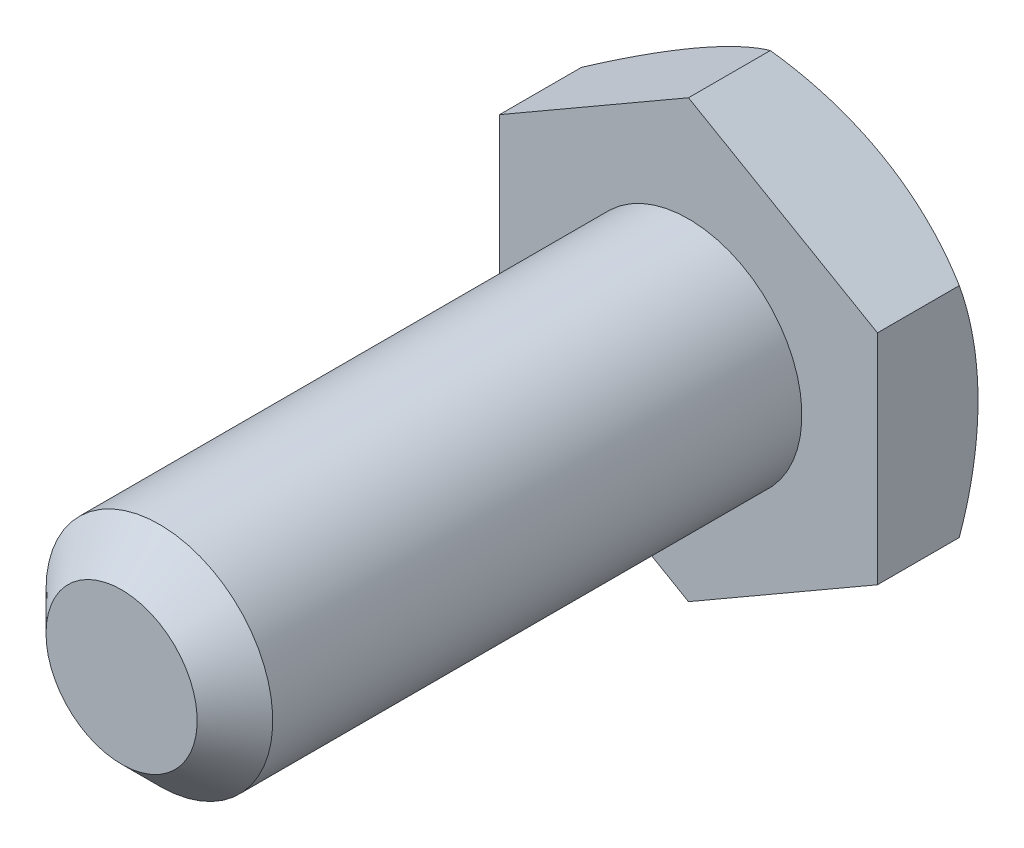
ISO-10303-21;
HEADER;
FILE_DESCRIPTION(('STEP AP214'),'2;1');
FILE_NAME('part.step','',(''),(''),'','','');
FILE_SCHEMA(('AUTOMOTIVE_DESIGN { 1 0 10303 214 1 1 1 1 }'));
ENDSEC;
DATA;
#1=APPLICATION_CONTEXT('core data for automotive mechanical design processes');
#2=APPLICATION_PROTOCOL_DEFINITION('international standard','automotive_design',2000,#1);
#3=PRODUCT_CONTEXT('',#1,'mechanical');
#4=PRODUCT('Part','Part','',(#3));
#5=PRODUCT_RELATED_PRODUCT_CATEGORY('part','',(#4));
#6=PRODUCT_DEFINITION_FORMATION('','',#4);
#7=PRODUCT_DEFINITION_CONTEXT('part definition',#1,'design');
#8=PRODUCT_DEFINITION('design','',#6,#7);
#9=PRODUCT_DEFINITION_SHAPE('','',#8);
#10=(LENGTH_UNIT() NAMED_UNIT(*) SI_UNIT(.MILLI.,.METRE.));
#11=(NAMED_UNIT(*) PLANE_ANGLE_UNIT() SI_UNIT($,.RADIAN.));
#12=(NAMED_UNIT(*) SI_UNIT($,.STERADIAN.) SOLID_ANGLE_UNIT());
#13=UNCERTAINTY_MEASURE_WITH_UNIT(LENGTH_MEASURE(1.E-05),#10,'distance_accuracy_value','');
#14=(GEOMETRIC_REPRESENTATION_CONTEXT(3) GLOBAL_UNCERTAINTY_ASSIGNED_CONTEXT((#13)) GLOBAL_UNIT_ASSIGNED_CONTEXT((#10,
#11,#12)) REPRESENTATION_CONTEXT('',''));
#15=CARTESIAN_POINT('',(0.,0.,0.));
#16=DIRECTION('',(0.,0.,1.));
#17=DIRECTION('',(1.,0.,0.));
#18=AXIS2_PLACEMENT_3D('',#15,#16,#17);
#19=CARTESIAN_POINT('',(0.,2.,19.));
#20=DIRECTION('',(0.,0.,-1.));
#21=DIRECTION('',(-1.,0.,0.));
#22=AXIS2_PLACEMENT_3D('',#19,#20,#21);
#23=PLANE('',#22);
#24=CARTESIAN_POINT('',(0.,0.,19.));
#25=DIRECTION('',(0.,0.,-1.));
#26=DIRECTION('',(-1.,0.,0.));
#27=AXIS2_PLACEMENT_3D('',#24,#25,#26);
#28=CIRCLE('',#27,2.);
#29=CARTESIAN_POINT('',(-2.,0.,19.));
#30=VERTEX_POINT('',#29);
#31=EDGE_CURVE('E9',#30,#30,#28,.T.);
#32=ORIENTED_EDGE('',*,*,#31,.F.);
#33=EDGE_LOOP('',(#32));
#34=FACE_BOUND('',#33,.T.);
#35=ADVANCED_FACE('F14',(#34),#23,.F.);
#36=CARTESIAN_POINT('',(0.,0.,19.));
#37=DIRECTION('',(0.,0.,-1.));
#38=DIRECTION('',(-1.,0.,0.));
#39=AXIS2_PLACEMENT_3D('',#36,#37,#38);
#40=CONICAL_SURFACE('',#39,2.,0.785398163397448);
#41=CARTESIAN_POINT('',(0.,0.,18.));
#42=DIRECTION('',(0.,0.,-1.));
#43=DIRECTION('',(-1.,0.,0.));
#44=AXIS2_PLACEMENT_3D('',#41,#42,#43);
#45=CIRCLE('',#44,3.);
#46=CARTESIAN_POINT('',(-3.,0.,18.));
#47=VERTEX_POINT('',#46);
#48=EDGE_CURVE('E22',#47,#47,#45,.T.);
#49=ORIENTED_EDGE('',*,*,#48,.F.);
#50=EDGE_LOOP('',(#49));
#51=FACE_BOUND('',#50,.T.);
#52=ORIENTED_EDGE('',*,*,#31,.T.);
#53=EDGE_LOOP('',(#52));
#54=FACE_BOUND('',#53,.T.);
#55=ADVANCED_FACE('F118',(#51,#54),#40,.T.);
#56=CARTESIAN_POINT('',(0.,0.,-22.7262674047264));
#57=DIRECTION('',(0.,0.,-1.));
#58=DIRECTION('',(-1.,0.,0.));
#59=AXIS2_PLACEMENT_3D('',#56,#57,#58);
#60=CYLINDRICAL_SURFACE('',#59,3.);
#61=CARTESIAN_POINT('',(0.,0.,4.));
#62=DIRECTION('',(0.,0.,-1.));
#63=DIRECTION('',(-1.,0.,0.));
#64=AXIS2_PLACEMENT_3D('',#61,#62,#63);
#65=CIRCLE('',#64,3.);
#66=CARTESIAN_POINT('',(-3.,0.,4.));
#67=VERTEX_POINT('',#66);
#68=EDGE_CURVE('E111',#67,#67,#65,.T.);
#69=ORIENTED_EDGE('',*,*,#68,.F.);
#70=EDGE_LOOP('',(#69));
#71=FACE_BOUND('',#70,.T.);
#72=ORIENTED_EDGE('',*,*,#48,.T.);
#73=EDGE_LOOP('',(#72));
#74=FACE_BOUND('',#73,.T.);
#75=ADVANCED_FACE('F116',(#71,#74),#60,.T.);
#76=CARTESIAN_POINT('',(0.,5.77350269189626,4.));
#77=DIRECTION('',(0.,0.,-1.));
#78=DIRECTION('',(-1.,0.,0.));
#79=AXIS2_PLACEMENT_3D('',#76,#77,#78);
#80=PLANE('',#79);
#81=DIRECTION('',(0.,1.,0.));
#82=VECTOR('',#81,1.);
#83=CARTESIAN_POINT('',(5.,5.77350269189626,4.));
#84=LINE('',#83,#82);
#85=CARTESIAN_POINT('',(5.,-2.88675134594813,4.));
#86=VERTEX_POINT('',#85);
#87=CARTESIAN_POINT('',(5.,2.88675134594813,4.));
#88=VERTEX_POINT('',#87);
#89=EDGE_CURVE('E64',#86,#88,#84,.T.);
#90=ORIENTED_EDGE('',*,*,#89,.T.);
#91=DIRECTION('',(-0.866025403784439,0.5,0.));
#92=VECTOR('',#91,1.);
#93=CARTESIAN_POINT('',(0.,5.77350269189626,4.));
#94=LINE('',#93,#92);
#95=CARTESIAN_POINT('',(0.,5.77350269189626,4.));
#96=VERTEX_POINT('',#95);
#97=EDGE_CURVE('E106',#88,#96,#94,.T.);
#98=ORIENTED_EDGE('',*,*,#97,.T.);
#99=DIRECTION('',(-0.866025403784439,-0.5,0.));
#100=VECTOR('',#99,1.);
#101=CARTESIAN_POINT('',(0.,5.77350269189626,4.));
#102=LINE('',#101,#100);
#103=CARTESIAN_POINT('',(-5.,2.88675134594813,4.));
#104=VERTEX_POINT('',#103);
#105=EDGE_CURVE('E100',#96,#104,#102,.T.);
#106=ORIENTED_EDGE('',*,*,#105,.T.);
#107=DIRECTION('',(0.,-1.,0.));
#108=VECTOR('',#107,1.);
#109=CARTESIAN_POINT('',(-5.,5.77350269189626,4.));
#110=LINE('',#109,#108);
#111=CARTESIAN_POINT('',(-5.,-2.88675134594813,4.));
#112=VERTEX_POINT('',#111);
#113=EDGE_CURVE('E95',#104,#112,#110,.T.);
#114=ORIENTED_EDGE('',*,*,#113,.T.);
#115=DIRECTION('',(0.866025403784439,-0.5,0.));
#116=VECTOR('',#115,1.);
#117=CARTESIAN_POINT('',(-5.,-2.88675134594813,4.));
#118=LINE('',#117,#116);
#119=CARTESIAN_POINT('',(0.,-5.77350269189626,4.));
#120=VERTEX_POINT('',#119);
#121=EDGE_CURVE('E86',#112,#120,#118,.T.);
#122=ORIENTED_EDGE('',*,*,#121,.T.);
#123=DIRECTION('',(0.866025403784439,0.5,0.));
#124=VECTOR('',#123,1.);
#125=CARTESIAN_POINT('',(5.,-2.88675134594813,4.));
#126=LINE('',#125,#124);
#127=EDGE_CURVE('E75',#120,#86,#126,.T.);
#128=ORIENTED_EDGE('',*,*,#127,.T.);
#129=EDGE_LOOP('',(#90,#98,#106,#114,#122,#128));
#130=FACE_BOUND('',#129,.T.);
#131=ORIENTED_EDGE('',*,*,#68,.T.);
#132=EDGE_LOOP('',(#131));
#133=FACE_BOUND('',#132,.T.);
#134=ADVANCED_FACE('F83',(#130,#133),#80,.F.);
#135=CARTESIAN_POINT('',(5.,2.88675134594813,10.));
#136=DIRECTION('',(-0.5,-0.866025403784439,0.));
#137=DIRECTION('',(0.866025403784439,-0.5,0.));
#138=AXIS2_PLACEMENT_3D('',#135,#136,#137);
#139=PLANE('',#138);
#140=DIRECTION('',(0.,0.,-1.));
#141=VECTOR('',#140,1.);
#142=CARTESIAN_POINT('',(0.,5.77350269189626,10.));
#143=LINE('',#142,#141);
#144=CARTESIAN_POINT('',(0.,5.77350269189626,1.83503419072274));
#145=VERTEX_POINT('',#144);
#146=EDGE_CURVE('E70',#96,#145,#143,.T.);
#147=ORIENTED_EDGE('',*,*,#146,.F.);
#148=ORIENTED_EDGE('',*,*,#97,.F.);
#149=DIRECTION('',(0.,0.,-1.));
#150=VECTOR('',#149,1.);
#151=CARTESIAN_POINT('',(5.,2.88675134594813,10.));
#152=LINE('',#151,#150);
#153=CARTESIAN_POINT('',(5.,2.88675134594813,1.83503419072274));
#154=VERTEX_POINT('',#153);
#155=EDGE_CURVE('E29',#88,#154,#152,.T.);
#156=ORIENTED_EDGE('',*,*,#155,.T.);
#157=CARTESIAN_POINT('',(2.5,4.3301270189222,10.));
#158=DIRECTION('',(-0.5,-0.866025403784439,0.));
#159=DIRECTION('',(0.866025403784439,-0.5,0.));
#160=AXIS2_PLACEMENT_3D('',#157,#158,#159);
#161=CIRCLE('',#160,8.66025403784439);
#162=EDGE_CURVE('E108',#145,#154,#161,.T.);
#163=ORIENTED_EDGE('',*,*,#162,.F.);
#164=EDGE_LOOP('',(#147,#148,#156,#163));
#165=FACE_BOUND('',#164,.T.);
#166=ADVANCED_FACE('F135',(#165),#139,.F.);
#167=CARTESIAN_POINT('',(0.,5.77350269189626,10.));
#168=DIRECTION('',(0.5,-0.866025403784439,0.));
#169=DIRECTION('',(0.866025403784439,0.5,0.));
#170=AXIS2_PLACEMENT_3D('',#167,#168,#169);
#171=PLANE('',#170);
#172=DIRECTION('',(0.,0.,-1.));
#173=VECTOR('',#172,1.);
#174=CARTESIAN_POINT('',(-5.,2.88675134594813,10.));
#175=LINE('',#174,#173);
#176=CARTESIAN_POINT('',(-5.,2.88675134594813,1.83503419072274));
#177=VERTEX_POINT('',#176);
#178=EDGE_CURVE('E165',#104,#177,#175,.T.);
#179=ORIENTED_EDGE('',*,*,#178,.F.);
#180=ORIENTED_EDGE('',*,*,#105,.F.);
#181=ORIENTED_EDGE('',*,*,#146,.T.);
#182=CARTESIAN_POINT('',(-2.5,4.3301270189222,10.));
#183=DIRECTION('',(0.5,-0.866025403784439,0.));
#184=DIRECTION('',(0.866025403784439,0.5,0.));
#185=AXIS2_PLACEMENT_3D('',#182,#183,#184);
#186=CIRCLE('',#185,8.66025403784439);
#187=EDGE_CURVE('E103',#177,#145,#186,.T.);
#188=ORIENTED_EDGE('',*,*,#187,.F.);
#189=EDGE_LOOP('',(#179,#180,#181,#188));
#190=FACE_BOUND('',#189,.T.);
#191=ADVANCED_FACE('F138',(#190),#171,.F.);
#192=CARTESIAN_POINT('',(-5.,2.88675134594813,10.));
#193=DIRECTION('',(1.,0.,0.));
#194=DIRECTION('',(0.,1.,0.));
#195=AXIS2_PLACEMENT_3D('',#192,#193,#194);
#196=PLANE('',#195);
#197=DIRECTION('',(0.,0.,-1.));
#198=VECTOR('',#197,1.);
#199=CARTESIAN_POINT('',(-5.,-2.88675134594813,10.));
#200=LINE('',#199,#198);
#201=CARTESIAN_POINT('',(-5.,-2.88675134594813,1.83503419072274));
#202=VERTEX_POINT('',#201);
#203=EDGE_CURVE('E169',#112,#202,#200,.T.);
#204=ORIENTED_EDGE('',*,*,#203,.F.);
#205=ORIENTED_EDGE('',*,*,#113,.F.);
#206=ORIENTED_EDGE('',*,*,#178,.T.);
#207=CARTESIAN_POINT('',(-5.,0.,10.));
#208=DIRECTION('',(1.,0.,0.));
#209=DIRECTION('',(0.,1.,0.));
#210=AXIS2_PLACEMENT_3D('',#207,#208,#209);
#211=CIRCLE('',#210,8.66025403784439);
#212=EDGE_CURVE('E97',#202,#177,#211,.T.);
#213=ORIENTED_EDGE('',*,*,#212,.F.);
#214=EDGE_LOOP('',(#204,#205,#206,#213));
#215=FACE_BOUND('',#214,.T.);
#216=ADVANCED_FACE('F142',(#215),#196,.F.);
#217=CARTESIAN_POINT('',(-5.,-2.88675134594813,10.));
#218=DIRECTION('',(0.5,0.866025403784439,0.));
#219=DIRECTION('',(-0.866025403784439,0.5,0.));
#220=AXIS2_PLACEMENT_3D('',#217,#218,#219);
#221=PLANE('',#220);
#222=DIRECTION('',(0.,0.,-1.));
#223=VECTOR('',#222,1.);
#224=CARTESIAN_POINT('',(0.,-5.77350269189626,10.));
#225=LINE('',#224,#223);
#226=CARTESIAN_POINT('',(0.,-5.77350269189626,1.83503419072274));
#227=VERTEX_POINT('',#226);
#228=EDGE_CURVE('E80',#120,#227,#225,.T.);
#229=ORIENTED_EDGE('',*,*,#228,.F.);
#230=ORIENTED_EDGE('',*,*,#121,.F.);
#231=ORIENTED_EDGE('',*,*,#203,.T.);
#232=CARTESIAN_POINT('',(-2.5,-4.3301270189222,10.));
#233=DIRECTION('',(0.5,0.866025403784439,0.));
#234=DIRECTION('',(-0.866025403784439,0.5,0.));
#235=AXIS2_PLACEMENT_3D('',#232,#233,#234);
#236=CIRCLE('',#235,8.66025403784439);
#237=EDGE_CURVE('E92',#227,#202,#236,.T.);
#238=ORIENTED_EDGE('',*,*,#237,.F.);
#239=EDGE_LOOP('',(#229,#230,#231,#238));
#240=FACE_BOUND('',#239,.T.);
#241=ADVANCED_FACE('F146',(#240),#221,.F.);
#242=CARTESIAN_POINT('',(0.,-5.77350269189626,10.));
#243=DIRECTION('',(-0.5,0.866025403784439,0.));
#244=DIRECTION('',(-0.866025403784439,-0.5,0.));
#245=AXIS2_PLACEMENT_3D('',#242,#243,#244);
#246=PLANE('',#245);
#247=DIRECTION('',(0.,0.,-1.));
#248=VECTOR('',#247,1.);
#249=CARTESIAN_POINT('',(5.,-2.88675134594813,10.));
#250=LINE('',#249,#248);
#251=CARTESIAN_POINT('',(5.,-2.88675134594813,1.83503419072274));
#252=VERTEX_POINT('',#251);
#253=EDGE_CURVE('E34',#86,#252,#250,.T.);
#254=ORIENTED_EDGE('',*,*,#253,.F.);
#255=ORIENTED_EDGE('',*,*,#127,.F.);
#256=ORIENTED_EDGE('',*,*,#228,.T.);
#257=CARTESIAN_POINT('',(2.5,-4.3301270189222,10.));
#258=DIRECTION('',(-0.5,0.866025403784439,0.));
#259=DIRECTION('',(-0.866025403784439,-0.5,0.));
#260=AXIS2_PLACEMENT_3D('',#257,#258,#259);
#261=CIRCLE('',#260,8.66025403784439);
#262=EDGE_CURVE('E78',#252,#227,#261,.T.);
#263=ORIENTED_EDGE('',*,*,#262,.F.);
#264=EDGE_LOOP('',(#254,#255,#256,#263));
#265=FACE_BOUND('',#264,.T.);
#266=ADVANCED_FACE('F73',(#265),#246,.F.);
#267=CARTESIAN_POINT('',(5.,-2.88675134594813,10.));
#268=DIRECTION('',(-1.,0.,0.));
#269=DIRECTION('',(0.,-1.,0.));
#270=AXIS2_PLACEMENT_3D('',#267,#268,#269);
#271=PLANE('',#270);
#272=ORIENTED_EDGE('',*,*,#155,.F.);
#273=ORIENTED_EDGE('',*,*,#89,.F.);
#274=ORIENTED_EDGE('',*,*,#253,.T.);
#275=CARTESIAN_POINT('',(5.,0.,10.));
#276=DIRECTION('',(-1.,0.,0.));
#277=DIRECTION('',(0.,-1.,0.));
#278=AXIS2_PLACEMENT_3D('',#275,#276,#277);
#279=CIRCLE('',#278,8.66025403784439);
#280=EDGE_CURVE('E69',#154,#252,#279,.T.);
#281=ORIENTED_EDGE('',*,*,#280,.F.);
#282=EDGE_LOOP('',(#272,#273,#274,#281));
#283=FACE_BOUND('',#282,.T.);
#284=ADVANCED_FACE('F65',(#283),#271,.F.);
#285=CARTESIAN_POINT('',(0.,0.,10.));
#286=DIRECTION('',(0.,0.,-1.));
#287=DIRECTION('',(0.,1.,0.));
#288=AXIS2_PLACEMENT_3D('',#285,#286,#287);
#289=SPHERICAL_SURFACE('',#288,10.);
#290=ORIENTED_EDGE('',*,*,#187,.T.);
#291=ORIENTED_EDGE('',*,*,#162,.T.);
#292=ORIENTED_EDGE('',*,*,#280,.T.);
#293=ORIENTED_EDGE('',*,*,#262,.T.);
#294=ORIENTED_EDGE('',*,*,#237,.T.);
#295=ORIENTED_EDGE('',*,*,#212,.T.);
#296=EDGE_LOOP('',(#290,#291,#292,#293,#294,#295));
#297=FACE_BOUND('',#296,.T.);
#298=ADVANCED_FACE('F16',(#297),#289,.T.);
#299=CLOSED_SHELL('',(#35,#55,#75,#134,#166,#191,#216,#241,#266,#284,#298));
#300=MANIFOLD_SOLID_BREP('B1',#299);
#301=ADVANCED_BREP_SHAPE_REPRESENTATION('',(#18,#300),#14);
#302=SHAPE_DEFINITION_REPRESENTATION(#9,#301);
ENDSEC;
END-ISO-10303-21;
